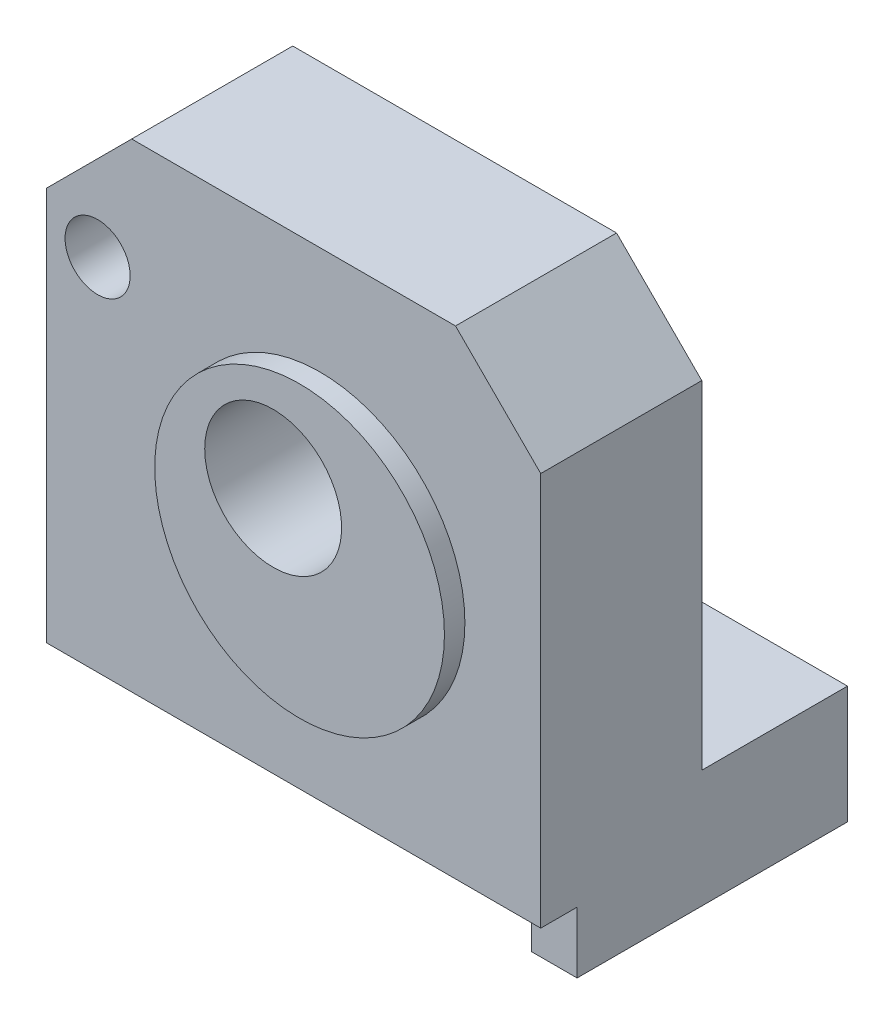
ISO-10303-21;
HEADER;
FILE_DESCRIPTION(('STEP AP214'),'2;1');
FILE_NAME('part.step','',(''),(''),'','','');
FILE_SCHEMA(('AUTOMOTIVE_DESIGN { 1 0 10303 214 1 1 1 1 }'));
ENDSEC;
DATA;
#1=APPLICATION_CONTEXT('core data for automotive mechanical design processes');
#2=APPLICATION_PROTOCOL_DEFINITION('international standard','automotive_design',2000,#1);
#3=PRODUCT_CONTEXT('',#1,'mechanical');
#4=PRODUCT('Part','Part','',(#3));
#5=PRODUCT_RELATED_PRODUCT_CATEGORY('part','',(#4));
#6=PRODUCT_DEFINITION_FORMATION('','',#4);
#7=PRODUCT_DEFINITION_CONTEXT('part definition',#1,'design');
#8=PRODUCT_DEFINITION('design','',#6,#7);
#9=PRODUCT_DEFINITION_SHAPE('','',#8);
#10=(LENGTH_UNIT() NAMED_UNIT(*) SI_UNIT(.MILLI.,.METRE.));
#11=(NAMED_UNIT(*) PLANE_ANGLE_UNIT() SI_UNIT($,.RADIAN.));
#12=(NAMED_UNIT(*) SI_UNIT($,.STERADIAN.) SOLID_ANGLE_UNIT());
#13=UNCERTAINTY_MEASURE_WITH_UNIT(LENGTH_MEASURE(1.E-05),#10,'distance_accuracy_value','');
#14=(GEOMETRIC_REPRESENTATION_CONTEXT(3) GLOBAL_UNCERTAINTY_ASSIGNED_CONTEXT((#13)) GLOBAL_UNIT_ASSIGNED_CONTEXT((#10,
#11,#12)) REPRESENTATION_CONTEXT('',''));
#15=CARTESIAN_POINT('',(0.,0.,0.));
#16=DIRECTION('',(0.,0.,1.));
#17=DIRECTION('',(1.,0.,0.));
#18=AXIS2_PLACEMENT_3D('',#15,#16,#17);
#19=CARTESIAN_POINT('',(-18.415,17.399,13.524));
#20=DIRECTION('',(0.,0.,1.));
#21=DIRECTION('',(1.,0.,0.));
#22=AXIS2_PLACEMENT_3D('',#19,#20,#21);
#23=PLANE('',#22);
#24=CARTESIAN_POINT('',(1.9685,-3.06439873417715,13.524));
#25=DIRECTION('',(0.,0.,1.));
#26=DIRECTION('',(1.,0.,0.));
#27=AXIS2_PLACEMENT_3D('',#24,#25,#26);
#28=CIRCLE('',#27,10.795);
#29=CARTESIAN_POINT('',(12.7635,-3.06439873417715,13.524));
#30=VERTEX_POINT('',#29);
#31=EDGE_CURVE('E305',#30,#30,#28,.F.);
#32=ORIENTED_EDGE('',*,*,#31,.F.);
#33=EDGE_LOOP('',(#32));
#34=FACE_BOUND('',#33,.T.);
#35=CARTESIAN_POINT('',(0.,0.,13.524));
#36=DIRECTION('',(0.,0.,-1.));
#37=DIRECTION('',(-1.,0.,0.));
#38=AXIS2_PLACEMENT_3D('',#35,#36,#37);
#39=CIRCLE('',#38,5.09999999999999);
#40=CARTESIAN_POINT('',(-5.09999999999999,0.,13.524));
#41=VERTEX_POINT('',#40);
#42=EDGE_CURVE('E282',#41,#41,#39,.T.);
#43=ORIENTED_EDGE('',*,*,#42,.T.);
#44=EDGE_LOOP('',(#43));
#45=FACE_BOUND('',#44,.T.);
#46=ADVANCED_FACE('F32',(#34,#45),#23,.T.);
#47=CARTESIAN_POINT('',(-18.415,17.399,12.));
#48=DIRECTION('',(1.,0.,0.));
#49=DIRECTION('',(0.,1.,0.));
#50=AXIS2_PLACEMENT_3D('',#47,#48,#49);
#51=PLANE('',#50);
#52=DIRECTION('',(0.,1.,0.));
#53=VECTOR('',#52,1.);
#54=CARTESIAN_POINT('',(-18.415,-24.511,9.28982));
#55=LINE('',#54,#53);
#56=CARTESIAN_POINT('',(-18.415,-22.479,9.28982));
#57=VERTEX_POINT('',#56);
#58=CARTESIAN_POINT('',(-18.415,-19.939,9.28982));
#59=VERTEX_POINT('',#58);
#60=EDGE_CURVE('E292',#57,#59,#55,.T.);
#61=ORIENTED_EDGE('',*,*,#60,.T.);
#62=DIRECTION('',(0.,0.,1.));
#63=VECTOR('',#62,1.);
#64=CARTESIAN_POINT('',(-18.415,-19.939,12.));
#65=LINE('',#64,#63);
#66=CARTESIAN_POINT('',(-18.415,-19.939,12.));
#67=VERTEX_POINT('',#66);
#68=EDGE_CURVE('E328',#59,#67,#65,.T.);
#69=ORIENTED_EDGE('',*,*,#68,.T.);
#70=DIRECTION('',(0.,-1.,0.));
#71=VECTOR('',#70,1.);
#72=CARTESIAN_POINT('',(-18.415,17.399,12.));
#73=LINE('',#72,#71);
#74=CARTESIAN_POINT('',(-18.415,9.39799999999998,12.));
#75=VERTEX_POINT('',#74);
#76=EDGE_CURVE('E195',#75,#67,#73,.T.);
#77=ORIENTED_EDGE('',*,*,#76,.F.);
#78=DIRECTION('',(0.,0.,-1.));
#79=VECTOR('',#78,1.);
#80=CARTESIAN_POINT('',(-18.415,9.39799999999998,0.));
#81=LINE('',#80,#79);
#82=CARTESIAN_POINT('',(-18.415,9.39799999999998,0.));
#83=VERTEX_POINT('',#82);
#84=EDGE_CURVE('E42',#75,#83,#81,.T.);
#85=ORIENTED_EDGE('',*,*,#84,.T.);
#86=DIRECTION('',(0.,-1.,0.));
#87=VECTOR('',#86,1.);
#88=CARTESIAN_POINT('',(-18.415,17.399,0.));
#89=LINE('',#88,#87);
#90=CARTESIAN_POINT('',(-18.415,-15.748,0.));
#91=VERTEX_POINT('',#90);
#92=EDGE_CURVE('E192',#83,#91,#89,.T.);
#93=ORIENTED_EDGE('',*,*,#92,.T.);
#94=DIRECTION('',(0.,0.,1.));
#95=VECTOR('',#94,1.);
#96=CARTESIAN_POINT('',(-18.415,-15.748,-10.86));
#97=LINE('',#96,#95);
#98=CARTESIAN_POINT('',(-18.415,-15.748,-10.86));
#99=VERTEX_POINT('',#98);
#100=EDGE_CURVE('E294',#99,#91,#97,.T.);
#101=ORIENTED_EDGE('',*,*,#100,.F.);
#102=DIRECTION('',(0.,-1.,0.));
#103=VECTOR('',#102,1.);
#104=CARTESIAN_POINT('',(-18.415,-22.479,-10.86));
#105=LINE('',#104,#103);
#106=CARTESIAN_POINT('',(-18.415,-22.479,-10.86));
#107=VERTEX_POINT('',#106);
#108=EDGE_CURVE('E149',#99,#107,#105,.T.);
#109=ORIENTED_EDGE('',*,*,#108,.T.);
#110=DIRECTION('',(0.,0.,1.));
#111=VECTOR('',#110,1.);
#112=CARTESIAN_POINT('',(-18.415,-22.479,-10.86));
#113=LINE('',#112,#111);
#114=EDGE_CURVE('E219',#107,#57,#113,.T.);
#115=ORIENTED_EDGE('',*,*,#114,.T.);
#116=EDGE_LOOP('',(#61,#69,#77,#85,#93,#101,#109,#115));
#117=FACE_BOUND('',#116,.T.);
#118=ADVANCED_FACE('F34',(#117),#51,.F.);
#119=CARTESIAN_POINT('',(18.415,17.399,12.));
#120=DIRECTION('',(-1.,0.,0.));
#121=DIRECTION('',(0.,0.,1.));
#122=AXIS2_PLACEMENT_3D('',#119,#120,#121);
#123=PLANE('',#122);
#124=DIRECTION('',(0.,1.,0.));
#125=VECTOR('',#124,1.);
#126=CARTESIAN_POINT('',(18.415,17.399,12.));
#127=LINE('',#126,#125);
#128=CARTESIAN_POINT('',(18.415,-19.939,12.));
#129=VERTEX_POINT('',#128);
#130=CARTESIAN_POINT('',(18.415,9.39799999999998,12.));
#131=VERTEX_POINT('',#130);
#132=EDGE_CURVE('E313',#129,#131,#127,.T.);
#133=ORIENTED_EDGE('',*,*,#132,.F.);
#134=DIRECTION('',(0.,0.,1.));
#135=VECTOR('',#134,1.);
#136=CARTESIAN_POINT('',(18.415,-19.939,12.));
#137=LINE('',#136,#135);
#138=CARTESIAN_POINT('',(18.415,-19.939,9.28982000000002));
#139=VERTEX_POINT('',#138);
#140=EDGE_CURVE('E134',#139,#129,#137,.T.);
#141=ORIENTED_EDGE('',*,*,#140,.F.);
#142=DIRECTION('',(0.,1.,0.));
#143=VECTOR('',#142,1.);
#144=CARTESIAN_POINT('',(18.415,-24.511,9.28982000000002));
#145=LINE('',#144,#143);
#146=CARTESIAN_POINT('',(18.415,-24.511,9.28982000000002));
#147=VERTEX_POINT('',#146);
#148=EDGE_CURVE('E123',#147,#139,#145,.T.);
#149=ORIENTED_EDGE('',*,*,#148,.F.);
#150=DIRECTION('',(0.,0.,1.));
#151=VECTOR('',#150,1.);
#152=CARTESIAN_POINT('',(18.415,-24.511,-10.86));
#153=LINE('',#152,#151);
#154=CARTESIAN_POINT('',(18.415,-24.511,-10.86));
#155=VERTEX_POINT('',#154);
#156=EDGE_CURVE('E133',#155,#147,#153,.T.);
#157=ORIENTED_EDGE('',*,*,#156,.F.);
#158=DIRECTION('',(0.,1.,0.));
#159=VECTOR('',#158,1.);
#160=CARTESIAN_POINT('',(18.415,-22.479,-10.86));
#161=LINE('',#160,#159);
#162=CARTESIAN_POINT('',(18.415,-15.748,-10.86));
#163=VERTEX_POINT('',#162);
#164=EDGE_CURVE('E155',#155,#163,#161,.T.);
#165=ORIENTED_EDGE('',*,*,#164,.T.);
#166=DIRECTION('',(0.,0.,1.));
#167=VECTOR('',#166,1.);
#168=CARTESIAN_POINT('',(18.415,-15.748,-10.86));
#169=LINE('',#168,#167);
#170=CARTESIAN_POINT('',(18.415,-15.748,0.));
#171=VERTEX_POINT('',#170);
#172=EDGE_CURVE('E302',#163,#171,#169,.T.);
#173=ORIENTED_EDGE('',*,*,#172,.T.);
#174=DIRECTION('',(0.,1.,0.));
#175=VECTOR('',#174,1.);
#176=CARTESIAN_POINT('',(18.415,17.399,0.));
#177=LINE('',#176,#175);
#178=CARTESIAN_POINT('',(18.415,9.39799999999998,0.));
#179=VERTEX_POINT('',#178);
#180=EDGE_CURVE('E204',#171,#179,#177,.T.);
#181=ORIENTED_EDGE('',*,*,#180,.T.);
#182=DIRECTION('',(0.,0.,1.));
#183=VECTOR('',#182,1.);
#184=CARTESIAN_POINT('',(18.415,9.39799999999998,12.));
#185=LINE('',#184,#183);
#186=EDGE_CURVE('E182',#179,#131,#185,.T.);
#187=ORIENTED_EDGE('',*,*,#186,.T.);
#188=EDGE_LOOP('',(#133,#141,#149,#157,#165,#173,#181,#187));
#189=FACE_BOUND('',#188,.T.);
#190=ADVANCED_FACE('F131',(#189),#123,.F.);
#191=CARTESIAN_POINT('',(-18.415,17.399,12.));
#192=DIRECTION('',(0.,0.,1.));
#193=DIRECTION('',(1.,0.,0.));
#194=AXIS2_PLACEMENT_3D('',#191,#192,#193);
#195=PLANE('',#194);
#196=DIRECTION('',(1.,0.,0.));
#197=VECTOR('',#196,1.);
#198=CARTESIAN_POINT('',(-18.415,-19.939,12.));
#199=LINE('',#198,#197);
#200=EDGE_CURVE('E280',#67,#129,#199,.T.);
#201=ORIENTED_EDGE('',*,*,#200,.T.);
#202=ORIENTED_EDGE('',*,*,#132,.T.);
#203=DIRECTION('',(-0.707106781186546,0.707106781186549,0.));
#204=VECTOR('',#203,1.);
#205=CARTESIAN_POINT('',(-4.00049999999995,31.8135,12.));
#206=LINE('',#205,#204);
#207=CARTESIAN_POINT('',(12.065,15.748,12.));
#208=VERTEX_POINT('',#207);
#209=EDGE_CURVE('E186',#131,#208,#206,.T.);
#210=ORIENTED_EDGE('',*,*,#209,.T.);
#211=DIRECTION('',(1.,0.,0.));
#212=VECTOR('',#211,1.);
#213=CARTESIAN_POINT('',(18.415,15.748,12.));
#214=LINE('',#213,#212);
#215=CARTESIAN_POINT('',(-12.065,15.748,12.));
#216=VERTEX_POINT('',#215);
#217=EDGE_CURVE('E170',#216,#208,#214,.T.);
#218=ORIENTED_EDGE('',*,*,#217,.F.);
#219=DIRECTION('',(-0.707106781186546,-0.707106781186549,0.));
#220=VECTOR('',#219,1.);
#221=CARTESIAN_POINT('',(-14.4145,13.3985,12.));
#222=LINE('',#221,#220);
#223=EDGE_CURVE('E56',#216,#75,#222,.T.);
#224=ORIENTED_EDGE('',*,*,#223,.T.);
#225=ORIENTED_EDGE('',*,*,#76,.T.);
#226=EDGE_LOOP('',(#201,#202,#210,#218,#224,#225));
#227=FACE_BOUND('',#226,.T.);
#228=CARTESIAN_POINT('',(-14.605,6.858,12.));
#229=DIRECTION('',(0.,0.,-1.));
#230=DIRECTION('',(-1.,0.,0.));
#231=AXIS2_PLACEMENT_3D('',#228,#229,#230);
#232=CIRCLE('',#231,2.42570000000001);
#233=CARTESIAN_POINT('',(-17.0307,6.858,12.));
#234=VERTEX_POINT('',#233);
#235=EDGE_CURVE('E205',#234,#234,#232,.T.);
#236=ORIENTED_EDGE('',*,*,#235,.T.);
#237=EDGE_LOOP('',(#236));
#238=FACE_BOUND('',#237,.T.);
#239=CARTESIAN_POINT('',(1.9685,-3.06439873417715,12.));
#240=DIRECTION('',(0.,0.,1.));
#241=DIRECTION('',(1.,0.,0.));
#242=AXIS2_PLACEMENT_3D('',#239,#240,#241);
#243=CIRCLE('',#242,10.795);
#244=CARTESIAN_POINT('',(12.7635,-3.06439873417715,12.));
#245=VERTEX_POINT('',#244);
#246=EDGE_CURVE('E310',#245,#245,#243,.T.);
#247=ORIENTED_EDGE('',*,*,#246,.F.);
#248=EDGE_LOOP('',(#247));
#249=FACE_BOUND('',#248,.T.);
#250=ADVANCED_FACE('F215',(#227,#238,#249),#195,.T.);
#251=CARTESIAN_POINT('',(-18.415,17.399,0.));
#252=DIRECTION('',(0.,0.,1.));
#253=DIRECTION('',(1.,0.,0.));
#254=AXIS2_PLACEMENT_3D('',#251,#252,#253);
#255=PLANE('',#254);
#256=CARTESIAN_POINT('',(0.,0.,0.));
#257=DIRECTION('',(0.,0.,-1.));
#258=DIRECTION('',(-1.,0.,0.));
#259=AXIS2_PLACEMENT_3D('',#256,#257,#258);
#260=CIRCLE('',#259,5.09999999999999);
#261=CARTESIAN_POINT('',(-5.09999999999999,0.,0.));
#262=VERTEX_POINT('',#261);
#263=EDGE_CURVE('E290',#262,#262,#260,.T.);
#264=ORIENTED_EDGE('',*,*,#263,.F.);
#265=EDGE_LOOP('',(#264));
#266=FACE_BOUND('',#265,.T.);
#267=CARTESIAN_POINT('',(-14.605,6.858,0.));
#268=DIRECTION('',(0.,0.,-1.));
#269=DIRECTION('',(-1.,0.,0.));
#270=AXIS2_PLACEMENT_3D('',#267,#268,#269);
#271=CIRCLE('',#270,2.42570000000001);
#272=CARTESIAN_POINT('',(-17.0307,6.858,0.));
#273=VERTEX_POINT('',#272);
#274=EDGE_CURVE('E309',#273,#273,#271,.T.);
#275=ORIENTED_EDGE('',*,*,#274,.F.);
#276=EDGE_LOOP('',(#275));
#277=FACE_BOUND('',#276,.T.);
#278=DIRECTION('',(-1.,0.,0.));
#279=VECTOR('',#278,1.);
#280=CARTESIAN_POINT('',(18.415,15.748,0.));
#281=LINE('',#280,#279);
#282=CARTESIAN_POINT('',(12.065,15.748,0.));
#283=VERTEX_POINT('',#282);
#284=CARTESIAN_POINT('',(-12.065,15.748,0.));
#285=VERTEX_POINT('',#284);
#286=EDGE_CURVE('E213',#283,#285,#281,.T.);
#287=ORIENTED_EDGE('',*,*,#286,.F.);
#288=DIRECTION('',(0.707106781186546,-0.707106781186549,0.));
#289=VECTOR('',#288,1.);
#290=CARTESIAN_POINT('',(12.065,15.748,0.));
#291=LINE('',#290,#289);
#292=EDGE_CURVE('E180',#283,#179,#291,.T.);
#293=ORIENTED_EDGE('',*,*,#292,.T.);
#294=ORIENTED_EDGE('',*,*,#180,.F.);
#295=DIRECTION('',(-1.,0.,0.));
#296=VECTOR('',#295,1.);
#297=CARTESIAN_POINT('',(-18.415,-15.748,0.));
#298=LINE('',#297,#296);
#299=EDGE_CURVE('E175',#171,#91,#298,.T.);
#300=ORIENTED_EDGE('',*,*,#299,.T.);
#301=ORIENTED_EDGE('',*,*,#92,.F.);
#302=DIRECTION('',(0.707106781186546,0.707106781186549,0.));
#303=VECTOR('',#302,1.);
#304=CARTESIAN_POINT('',(-12.065,15.748,0.));
#305=LINE('',#304,#303);
#306=EDGE_CURVE('E178',#83,#285,#305,.T.);
#307=ORIENTED_EDGE('',*,*,#306,.T.);
#308=EDGE_LOOP('',(#287,#293,#294,#300,#301,#307));
#309=FACE_BOUND('',#308,.T.);
#310=ADVANCED_FACE('F201',(#266,#277,#309),#255,.F.);
#311=CARTESIAN_POINT('',(-18.415,-22.479,12.));
#312=DIRECTION('',(0.,1.,0.));
#313=DIRECTION('',(-1.,0.,0.));
#314=AXIS2_PLACEMENT_3D('',#311,#312,#313);
#315=PLANE('',#314);
#316=DIRECTION('',(0.,0.,-1.));
#317=VECTOR('',#316,1.);
#318=CARTESIAN_POINT('',(14.999999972,-22.479,-10.86));
#319=LINE('',#318,#317);
#320=CARTESIAN_POINT('',(14.999999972,-22.479,9.28982000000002));
#321=VERTEX_POINT('',#320);
#322=CARTESIAN_POINT('',(14.999999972,-22.479,-10.86));
#323=VERTEX_POINT('',#322);
#324=EDGE_CURVE('E36',#321,#323,#319,.T.);
#325=ORIENTED_EDGE('',*,*,#324,.F.);
#326=DIRECTION('',(-1.,0.,0.));
#327=VECTOR('',#326,1.);
#328=CARTESIAN_POINT('',(-18.415,-22.479,9.28982));
#329=LINE('',#328,#327);
#330=EDGE_CURVE('E275',#321,#57,#329,.T.);
#331=ORIENTED_EDGE('',*,*,#330,.T.);
#332=ORIENTED_EDGE('',*,*,#114,.F.);
#333=DIRECTION('',(1.,0.,0.));
#334=VECTOR('',#333,1.);
#335=CARTESIAN_POINT('',(-18.415,-22.479,-10.86));
#336=LINE('',#335,#334);
#337=EDGE_CURVE('E152',#107,#323,#336,.T.);
#338=ORIENTED_EDGE('',*,*,#337,.T.);
#339=EDGE_LOOP('',(#325,#331,#332,#338));
#340=FACE_BOUND('',#339,.T.);
#341=CARTESIAN_POINT('',(-10.500000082,-22.479,-3.96000008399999));
#342=DIRECTION('',(0.,1.,0.));
#343=DIRECTION('',(-1.,0.,0.));
#344=AXIS2_PLACEMENT_3D('',#341,#342,#343);
#345=CIRCLE('',#344,1.5494);
#346=CARTESIAN_POINT('',(-12.049400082,-22.479,-3.96000008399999));
#347=VERTEX_POINT('',#346);
#348=EDGE_CURVE('E143',#347,#347,#345,.T.);
#349=ORIENTED_EDGE('',*,*,#348,.T.);
#350=EDGE_LOOP('',(#349));
#351=FACE_BOUND('',#350,.T.);
#352=CARTESIAN_POINT('',(10.500000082,-22.479,-3.96000008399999));
#353=DIRECTION('',(0.,1.,0.));
#354=DIRECTION('',(-1.,0.,0.));
#355=AXIS2_PLACEMENT_3D('',#352,#353,#354);
#356=CIRCLE('',#355,1.5494);
#357=CARTESIAN_POINT('',(8.950600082,-22.479,-3.96000008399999));
#358=VERTEX_POINT('',#357);
#359=EDGE_CURVE('E166',#358,#358,#356,.F.);
#360=ORIENTED_EDGE('',*,*,#359,.F.);
#361=EDGE_LOOP('',(#360));
#362=FACE_BOUND('',#361,.T.);
#363=ADVANCED_FACE('F227',(#340,#351,#362),#315,.F.);
#364=CARTESIAN_POINT('',(-18.415,-15.748,-10.86));
#365=DIRECTION('',(0.,1.,0.));
#366=DIRECTION('',(0.,0.,1.));
#367=AXIS2_PLACEMENT_3D('',#364,#365,#366);
#368=PLANE('',#367);
#369=ORIENTED_EDGE('',*,*,#299,.F.);
#370=ORIENTED_EDGE('',*,*,#172,.F.);
#371=DIRECTION('',(-1.,0.,0.));
#372=VECTOR('',#371,1.);
#373=CARTESIAN_POINT('',(-18.415,-15.748,-10.86));
#374=LINE('',#373,#372);
#375=EDGE_CURVE('E299',#163,#99,#374,.T.);
#376=ORIENTED_EDGE('',*,*,#375,.T.);
#377=ORIENTED_EDGE('',*,*,#100,.T.);
#378=EDGE_LOOP('',(#369,#370,#376,#377));
#379=FACE_BOUND('',#378,.T.);
#380=CARTESIAN_POINT('',(-10.500000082,-15.748,-3.96000008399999));
#381=DIRECTION('',(0.,1.,0.));
#382=DIRECTION('',(0.,0.,1.));
#383=AXIS2_PLACEMENT_3D('',#380,#381,#382);
#384=CIRCLE('',#383,1.5494);
#385=CARTESIAN_POINT('',(-10.500000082,-15.748,-2.41060008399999));
#386=VERTEX_POINT('',#385);
#387=EDGE_CURVE('E163',#386,#386,#384,.T.);
#388=ORIENTED_EDGE('',*,*,#387,.F.);
#389=EDGE_LOOP('',(#388));
#390=FACE_BOUND('',#389,.T.);
#391=CARTESIAN_POINT('',(10.500000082,-15.748,-3.96000008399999));
#392=DIRECTION('',(0.,1.,0.));
#393=DIRECTION('',(0.,0.,1.));
#394=AXIS2_PLACEMENT_3D('',#391,#392,#393);
#395=CIRCLE('',#394,1.5494);
#396=CARTESIAN_POINT('',(10.500000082,-15.748,-2.41060008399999));
#397=VERTEX_POINT('',#396);
#398=EDGE_CURVE('E167',#397,#397,#395,.F.);
#399=ORIENTED_EDGE('',*,*,#398,.T.);
#400=EDGE_LOOP('',(#399));
#401=FACE_BOUND('',#400,.T.);
#402=ADVANCED_FACE('F258',(#379,#390,#401),#368,.T.);
#403=CARTESIAN_POINT('',(-14.605,6.858,12.));
#404=DIRECTION('',(0.,0.,-1.));
#405=DIRECTION('',(-1.,0.,0.));
#406=AXIS2_PLACEMENT_3D('',#403,#404,#405);
#407=CYLINDRICAL_SURFACE('',#406,2.42570000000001);
#408=ORIENTED_EDGE('',*,*,#235,.F.);
#409=EDGE_LOOP('',(#408));
#410=FACE_BOUND('',#409,.T.);
#411=ORIENTED_EDGE('',*,*,#274,.T.);
#412=EDGE_LOOP('',(#411));
#413=FACE_BOUND('',#412,.T.);
#414=ADVANCED_FACE('F255',(#410,#413),#407,.F.);
#415=CARTESIAN_POINT('',(1.9685,-3.06439873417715,45.5808708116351));
#416=DIRECTION('',(0.,0.,-1.));
#417=DIRECTION('',(-1.,0.,0.));
#418=AXIS2_PLACEMENT_3D('',#415,#416,#417);
#419=CYLINDRICAL_SURFACE('',#418,10.795);
#420=ORIENTED_EDGE('',*,*,#246,.T.);
#421=EDGE_LOOP('',(#420));
#422=FACE_BOUND('',#421,.T.);
#423=ORIENTED_EDGE('',*,*,#31,.T.);
#424=EDGE_LOOP('',(#423));
#425=FACE_BOUND('',#424,.T.);
#426=ADVANCED_FACE('F253',(#422,#425),#419,.T.);
#427=CARTESIAN_POINT('',(-18.415,-15.748,-10.86));
#428=DIRECTION('',(0.,0.,-1.));
#429=DIRECTION('',(-1.,0.,0.));
#430=AXIS2_PLACEMENT_3D('',#427,#428,#429);
#431=PLANE('',#430);
#432=ORIENTED_EDGE('',*,*,#337,.F.);
#433=ORIENTED_EDGE('',*,*,#108,.F.);
#434=ORIENTED_EDGE('',*,*,#375,.F.);
#435=ORIENTED_EDGE('',*,*,#164,.F.);
#436=DIRECTION('',(1.,0.,0.));
#437=VECTOR('',#436,1.);
#438=CARTESIAN_POINT('',(18.415,-24.511,-10.86));
#439=LINE('',#438,#437);
#440=CARTESIAN_POINT('',(14.999999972,-24.511,-10.86));
#441=VERTEX_POINT('',#440);
#442=EDGE_CURVE('E139',#441,#155,#439,.T.);
#443=ORIENTED_EDGE('',*,*,#442,.F.);
#444=DIRECTION('',(0.,1.,0.));
#445=VECTOR('',#444,1.);
#446=CARTESIAN_POINT('',(14.999999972,-24.511,-10.86));
#447=LINE('',#446,#445);
#448=EDGE_CURVE('E148',#441,#323,#447,.T.);
#449=ORIENTED_EDGE('',*,*,#448,.T.);
#450=EDGE_LOOP('',(#432,#433,#434,#435,#443,#449));
#451=FACE_BOUND('',#450,.T.);
#452=ADVANCED_FACE('F298',(#451),#431,.T.);
#453=CARTESIAN_POINT('',(14.999999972,-24.511,-10.86));
#454=DIRECTION('',(1.,0.,0.));
#455=DIRECTION('',(0.,0.,-1.));
#456=AXIS2_PLACEMENT_3D('',#453,#454,#455);
#457=PLANE('',#456);
#458=DIRECTION('',(0.,0.,-1.));
#459=VECTOR('',#458,1.);
#460=CARTESIAN_POINT('',(14.999999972,-24.511,-10.86));
#461=LINE('',#460,#459);
#462=CARTESIAN_POINT('',(14.999999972,-24.511,9.28982000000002));
#463=VERTEX_POINT('',#462);
#464=EDGE_CURVE('E140',#463,#441,#461,.T.);
#465=ORIENTED_EDGE('',*,*,#464,.F.);
#466=DIRECTION('',(0.,1.,0.));
#467=VECTOR('',#466,1.);
#468=CARTESIAN_POINT('',(14.999999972,-24.511,9.28982000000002));
#469=LINE('',#468,#467);
#470=EDGE_CURVE('E48',#463,#321,#469,.T.);
#471=ORIENTED_EDGE('',*,*,#470,.T.);
#472=ORIENTED_EDGE('',*,*,#324,.T.);
#473=ORIENTED_EDGE('',*,*,#448,.F.);
#474=EDGE_LOOP('',(#465,#471,#472,#473));
#475=FACE_BOUND('',#474,.T.);
#476=ADVANCED_FACE('F241',(#475),#457,.F.);
#477=CARTESIAN_POINT('',(18.415,-24.511,12.));
#478=DIRECTION('',(0.,-1.,0.));
#479=DIRECTION('',(0.,0.,-1.));
#480=AXIS2_PLACEMENT_3D('',#477,#478,#479);
#481=PLANE('',#480);
#482=DIRECTION('',(1.,0.,0.));
#483=VECTOR('',#482,1.);
#484=CARTESIAN_POINT('',(18.415,-24.511,9.28982000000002));
#485=LINE('',#484,#483);
#486=EDGE_CURVE('E12',#463,#147,#485,.T.);
#487=ORIENTED_EDGE('',*,*,#486,.F.);
#488=ORIENTED_EDGE('',*,*,#464,.T.);
#489=ORIENTED_EDGE('',*,*,#442,.T.);
#490=ORIENTED_EDGE('',*,*,#156,.T.);
#491=EDGE_LOOP('',(#487,#488,#489,#490));
#492=FACE_BOUND('',#491,.T.);
#493=ADVANCED_FACE('F137',(#492),#481,.T.);
#494=CARTESIAN_POINT('',(-10.500000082,17.399,-3.96000008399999));
#495=DIRECTION('',(0.,-1.,0.));
#496=DIRECTION('',(0.,0.,-1.));
#497=AXIS2_PLACEMENT_3D('',#494,#495,#496);
#498=CYLINDRICAL_SURFACE('',#497,1.5494);
#499=ORIENTED_EDGE('',*,*,#387,.T.);
#500=EDGE_LOOP('',(#499));
#501=FACE_BOUND('',#500,.T.);
#502=ORIENTED_EDGE('',*,*,#348,.F.);
#503=EDGE_LOOP('',(#502));
#504=FACE_BOUND('',#503,.T.);
#505=ADVANCED_FACE('F230',(#501,#504),#498,.F.);
#506=CARTESIAN_POINT('',(10.500000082,17.399,-3.96000008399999));
#507=DIRECTION('',(0.,-1.,0.));
#508=DIRECTION('',(0.,0.,-1.));
#509=AXIS2_PLACEMENT_3D('',#506,#507,#508);
#510=CYLINDRICAL_SURFACE('',#509,1.5494);
#511=ORIENTED_EDGE('',*,*,#398,.F.);
#512=EDGE_LOOP('',(#511));
#513=FACE_BOUND('',#512,.T.);
#514=ORIENTED_EDGE('',*,*,#359,.T.);
#515=EDGE_LOOP('',(#514));
#516=FACE_BOUND('',#515,.T.);
#517=ADVANCED_FACE('F232',(#513,#516),#510,.F.);
#518=CARTESIAN_POINT('',(18.415,15.748,0.));
#519=DIRECTION('',(0.,1.,0.));
#520=DIRECTION('',(0.,0.,1.));
#521=AXIS2_PLACEMENT_3D('',#518,#519,#520);
#522=PLANE('',#521);
#523=ORIENTED_EDGE('',*,*,#217,.T.);
#524=DIRECTION('',(0.,0.,-1.));
#525=VECTOR('',#524,1.);
#526=CARTESIAN_POINT('',(12.065,15.748,0.));
#527=LINE('',#526,#525);
#528=EDGE_CURVE('E174',#208,#283,#527,.T.);
#529=ORIENTED_EDGE('',*,*,#528,.T.);
#530=ORIENTED_EDGE('',*,*,#286,.T.);
#531=DIRECTION('',(0.,0.,1.));
#532=VECTOR('',#531,1.);
#533=CARTESIAN_POINT('',(-12.065,15.748,12.));
#534=LINE('',#533,#532);
#535=EDGE_CURVE('E171',#285,#216,#534,.T.);
#536=ORIENTED_EDGE('',*,*,#535,.T.);
#537=EDGE_LOOP('',(#523,#529,#530,#536));
#538=FACE_BOUND('',#537,.T.);
#539=ADVANCED_FACE('F211',(#538),#522,.T.);
#540=CARTESIAN_POINT('',(12.065,15.748,0.));
#541=DIRECTION('',(0.707106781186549,0.707106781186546,0.));
#542=DIRECTION('',(-0.707106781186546,0.707106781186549,0.));
#543=AXIS2_PLACEMENT_3D('',#540,#541,#542);
#544=PLANE('',#543);
#545=ORIENTED_EDGE('',*,*,#209,.F.);
#546=ORIENTED_EDGE('',*,*,#186,.F.);
#547=ORIENTED_EDGE('',*,*,#292,.F.);
#548=ORIENTED_EDGE('',*,*,#528,.F.);
#549=EDGE_LOOP('',(#545,#546,#547,#548));
#550=FACE_BOUND('',#549,.T.);
#551=ADVANCED_FACE('F324',(#550),#544,.T.);
#552=CARTESIAN_POINT('',(-12.065,15.748,0.));
#553=DIRECTION('',(-0.707106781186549,0.707106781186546,0.));
#554=DIRECTION('',(-0.707106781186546,-0.707106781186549,0.));
#555=AXIS2_PLACEMENT_3D('',#552,#553,#554);
#556=PLANE('',#555);
#557=ORIENTED_EDGE('',*,*,#306,.F.);
#558=ORIENTED_EDGE('',*,*,#84,.F.);
#559=ORIENTED_EDGE('',*,*,#223,.F.);
#560=ORIENTED_EDGE('',*,*,#535,.F.);
#561=EDGE_LOOP('',(#557,#558,#559,#560));
#562=FACE_BOUND('',#561,.T.);
#563=ADVANCED_FACE('F208',(#562),#556,.T.);
#564=CARTESIAN_POINT('',(0.,0.,0.));
#565=DIRECTION('',(0.,0.,-1.));
#566=DIRECTION('',(-1.,0.,0.));
#567=AXIS2_PLACEMENT_3D('',#564,#565,#566);
#568=CYLINDRICAL_SURFACE('',#567,5.09999999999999);
#569=ORIENTED_EDGE('',*,*,#42,.F.);
#570=EDGE_LOOP('',(#569));
#571=FACE_BOUND('',#570,.T.);
#572=ORIENTED_EDGE('',*,*,#263,.T.);
#573=EDGE_LOOP('',(#572));
#574=FACE_BOUND('',#573,.T.);
#575=ADVANCED_FACE('F337',(#571,#574),#568,.F.);
#576=CARTESIAN_POINT('',(-18.415,-24.511,9.28982));
#577=DIRECTION('',(0.,0.,-1.));
#578=DIRECTION('',(-1.,0.,0.));
#579=AXIS2_PLACEMENT_3D('',#576,#577,#578);
#580=PLANE('',#579);
#581=ORIENTED_EDGE('',*,*,#470,.F.);
#582=ORIENTED_EDGE('',*,*,#486,.T.);
#583=ORIENTED_EDGE('',*,*,#148,.T.);
#584=DIRECTION('',(1.,0.,0.));
#585=VECTOR('',#584,1.);
#586=CARTESIAN_POINT('',(-18.415,-19.939,9.28982));
#587=LINE('',#586,#585);
#588=EDGE_CURVE('E284',#59,#139,#587,.T.);
#589=ORIENTED_EDGE('',*,*,#588,.F.);
#590=ORIENTED_EDGE('',*,*,#60,.F.);
#591=ORIENTED_EDGE('',*,*,#330,.F.);
#592=EDGE_LOOP('',(#581,#582,#583,#589,#590,#591));
#593=FACE_BOUND('',#592,.T.);
#594=ADVANCED_FACE('F122',(#593),#580,.F.);
#595=CARTESIAN_POINT('',(-18.415,-19.939,12.));
#596=DIRECTION('',(0.,1.,0.));
#597=DIRECTION('',(0.,0.,1.));
#598=AXIS2_PLACEMENT_3D('',#595,#596,#597);
#599=PLANE('',#598);
#600=ORIENTED_EDGE('',*,*,#200,.F.);
#601=ORIENTED_EDGE('',*,*,#68,.F.);
#602=ORIENTED_EDGE('',*,*,#588,.T.);
#603=ORIENTED_EDGE('',*,*,#140,.T.);
#604=EDGE_LOOP('',(#600,#601,#602,#603));
#605=FACE_BOUND('',#604,.T.);
#606=ADVANCED_FACE('F327',(#605),#599,.F.);
#607=CLOSED_SHELL('',(#46,#118,#190,#250,#310,#363,#402,#414,#426,#452,#476,#493,#505,#517,#539,
#551,#563,#575,#594,#606));
#608=MANIFOLD_SOLID_BREP('B2',#607);
#609=ADVANCED_BREP_SHAPE_REPRESENTATION('',(#18,#608),#14);
#610=SHAPE_DEFINITION_REPRESENTATION(#9,#609);
ENDSEC;
END-ISO-10303-21;
